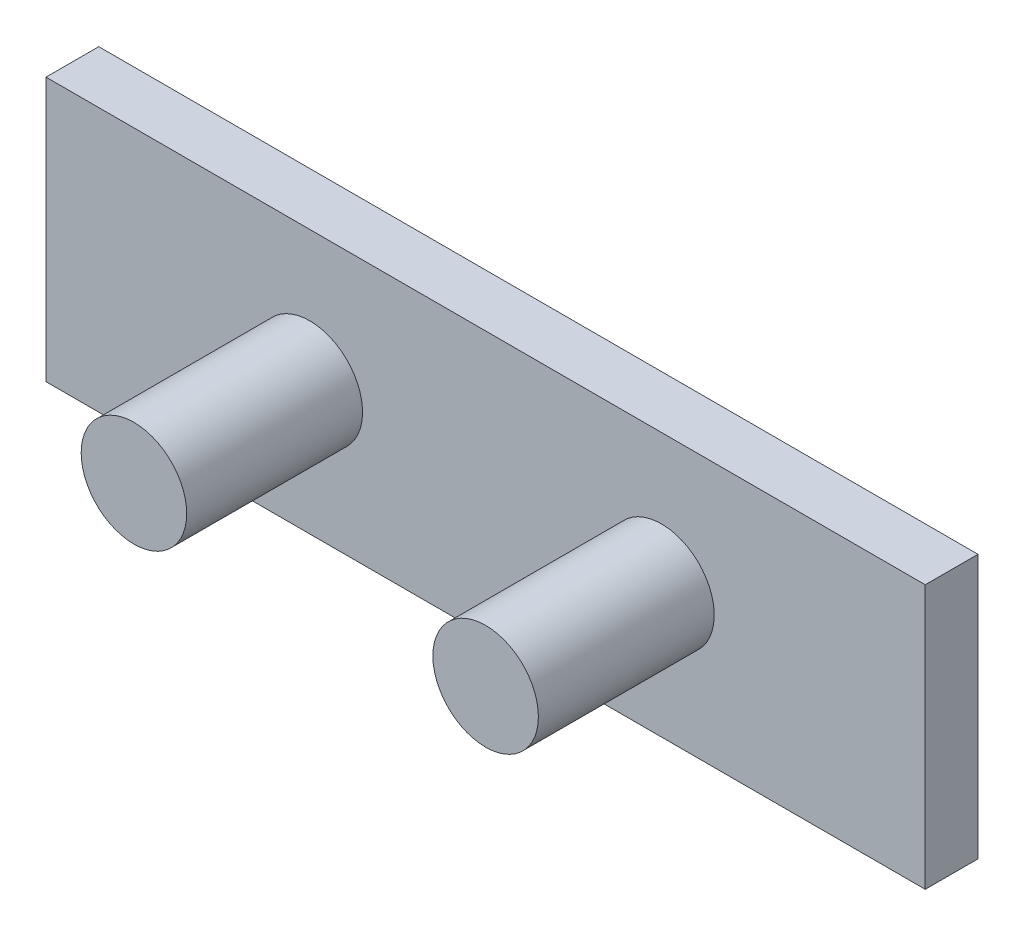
from build123d import *

# Parameters (mm, degrees)
SKIZZE1_W               = 50
SKIZZE1_H               = 15
LINEAR_AUSTRAGEN1_DEPTH = 3
SKIZZE2_R               = 3
LINEAR_AUSTRAGEN2_DEPTH = 10


with BuildPart() as part:
    # Skizze1 → Linear austragen1 (new body)
    with BuildSketch(Plane.XY):
        with Locations((25, 7.5)):
            Rectangle(SKIZZE1_W, SKIZZE1_H)
    extrude(amount=LINEAR_AUSTRAGEN1_DEPTH)

    # Skizze2 → Linear austragen2 (add)
    with BuildSketch(Plane.XY.offset(3)):
        with Locations(Location((15, 7.5, 0), (0, 0, 180))):
            Circle(SKIZZE2_R)
        with Locations(Location((35, 7.5, 0), (0, 0, 180))):
            Circle(SKIZZE2_R)
    extrude(amount=LINEAR_AUSTRAGEN2_DEPTH)


solid = part.part
